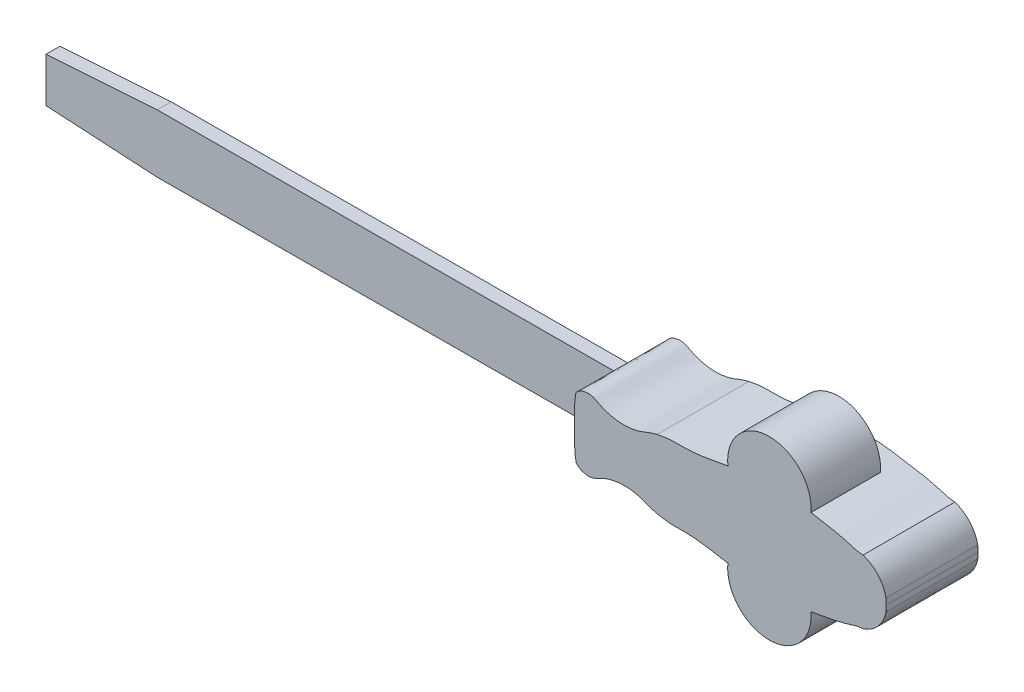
ISO-10303-21;
HEADER;
FILE_DESCRIPTION(('STEP AP214'),'2;1');
FILE_NAME('part.step','',(''),(''),'','','');
FILE_SCHEMA(('AUTOMOTIVE_DESIGN { 1 0 10303 214 1 1 1 1 }'));
ENDSEC;
DATA;
#1=APPLICATION_CONTEXT('core data for automotive mechanical design processes');
#2=APPLICATION_PROTOCOL_DEFINITION('international standard','automotive_design',2000,#1);
#3=PRODUCT_CONTEXT('',#1,'mechanical');
#4=PRODUCT('Part','Part','',(#3));
#5=PRODUCT_RELATED_PRODUCT_CATEGORY('part','',(#4));
#6=PRODUCT_DEFINITION_FORMATION('','',#4);
#7=PRODUCT_DEFINITION_CONTEXT('part definition',#1,'design');
#8=PRODUCT_DEFINITION('design','',#6,#7);
#9=PRODUCT_DEFINITION_SHAPE('','',#8);
#10=(LENGTH_UNIT() NAMED_UNIT(*) SI_UNIT(.MILLI.,.METRE.));
#11=(NAMED_UNIT(*) PLANE_ANGLE_UNIT() SI_UNIT($,.RADIAN.));
#12=(NAMED_UNIT(*) SI_UNIT($,.STERADIAN.) SOLID_ANGLE_UNIT());
#13=UNCERTAINTY_MEASURE_WITH_UNIT(LENGTH_MEASURE(1.E-05),#10,'distance_accuracy_value','');
#14=(GEOMETRIC_REPRESENTATION_CONTEXT(3) GLOBAL_UNCERTAINTY_ASSIGNED_CONTEXT((#13)) GLOBAL_UNIT_ASSIGNED_CONTEXT((#10,
#11,#12)) REPRESENTATION_CONTEXT('',''));
#15=CARTESIAN_POINT('',(0.,0.,0.));
#16=DIRECTION('',(0.,0.,1.));
#17=DIRECTION('',(1.,0.,0.));
#18=AXIS2_PLACEMENT_3D('',#15,#16,#17);
#19=CARTESIAN_POINT('',(5.05066941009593,-10.4757213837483,-2.5));
#20=DIRECTION('',(0.,0.,-1.));
#21=DIRECTION('',(-1.,0.,0.));
#22=AXIS2_PLACEMENT_3D('',#19,#20,#21);
#23=PLANE('',#22);
#24=DIRECTION('',(-0.999988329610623,-0.00483121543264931,0.));
#25=VECTOR('',#24,1.);
#26=CARTESIAN_POINT('',(5.05066941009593,-10.4757213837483,-2.5));
#27=LINE('',#26,#25);
#28=CARTESIAN_POINT('',(0.475948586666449,-10.4978231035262,-2.5));
#29=VERTEX_POINT('',#28);
#30=CARTESIAN_POINT('',(-163.946891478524,-11.2921945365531,-2.5));
#31=VERTEX_POINT('',#30);
#32=EDGE_CURVE('E233',#29,#31,#27,.T.);
#33=ORIENTED_EDGE('',*,*,#32,.T.);
#34=DIRECTION('',(-0.998342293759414,0.0575557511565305,0.));
#35=VECTOR('',#34,1.);
#36=CARTESIAN_POINT('',(4.44392236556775,-21.0001472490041,-2.5));
#37=LINE('',#36,#35);
#38=CARTESIAN_POINT('',(-203.958969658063,-8.985445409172,-2.5));
#39=VERTEX_POINT('',#38);
#40=EDGE_CURVE('E211',#31,#39,#37,.T.);
#41=ORIENTED_EDGE('',*,*,#40,.T.);
#42=DIRECTION('',(0.00483121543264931,-0.999988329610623,0.));
#43=VECTOR('',#42,1.);
#44=CARTESIAN_POINT('',(-203.946891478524,-11.485445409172,-2.5));
#45=LINE('',#44,#43);
#46=CARTESIAN_POINT('',(-204.036268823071,7.01430951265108,-2.5));
#47=VERTEX_POINT('',#46);
#48=EDGE_CURVE('E608',#47,#39,#45,.T.);
#49=ORIENTED_EDGE('',*,*,#48,.F.);
#50=DIRECTION('',(-0.997739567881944,-0.0671993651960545,0.));
#51=VECTOR('',#50,1.);
#52=CARTESIAN_POINT('',(2.93382184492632,20.9540781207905,-2.5));
#53=LINE('',#52,#51);
#54=CARTESIAN_POINT('',(-164.04834700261,9.70756038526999,-2.5));
#55=VERTEX_POINT('',#54);
#56=EDGE_CURVE('E65',#55,#47,#53,.T.);
#57=ORIENTED_EDGE('',*,*,#56,.F.);
#58=DIRECTION('',(-0.999988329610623,-0.00483121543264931,0.));
#59=VECTOR('',#58,1.);
#60=CARTESIAN_POINT('',(4.9492138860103,10.5240335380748,-2.5));
#61=LINE('',#60,#59);
#62=CARTESIAN_POINT('',(0.374493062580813,10.5019318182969,-2.5));
#63=VERTEX_POINT('',#62);
#64=EDGE_CURVE('E238',#63,#55,#61,.T.);
#65=ORIENTED_EDGE('',*,*,#64,.F.);
#66=CARTESIAN_POINT('',(-0.0328656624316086,3.40126746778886,-2.5));
#67=CARTESIAN_POINT('',(-0.224843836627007,7.16255319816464,-2.5));
#68=CARTESIAN_POINT('',(0.440236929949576,10.8822575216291,-2.5));
#69=B_SPLINE_CURVE_WITH_KNOTS('',2,(#66,#67,#68),.UNSPECIFIED.,.F.,.F.,(3,3),(0.,1.),.UNSPECIFIED.);
#70=CARTESIAN_POINT('',(-0.0328656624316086,3.40126746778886,-2.5));
#71=VERTEX_POINT('',#70);
#72=EDGE_CURVE('E271',#71,#63,#69,.T.);
#73=ORIENTED_EDGE('',*,*,#72,.F.);
#74=DIRECTION('',(-0.00966231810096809,0.999953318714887,0.));
#75=VECTOR('',#74,1.);
#76=CARTESIAN_POINT('',(0.,0.,-2.5));
#77=LINE('',#76,#75);
#78=CARTESIAN_POINT('',(0.,0.,-2.5));
#79=VERTEX_POINT('',#78);
#80=EDGE_CURVE('E585',#79,#71,#77,.T.);
#81=ORIENTED_EDGE('',*,*,#80,.F.);
#82=DIRECTION('',(0.,-1.,0.));
#83=VECTOR('',#82,1.);
#84=CARTESIAN_POINT('',(0.,0.,-2.5));
#85=LINE('',#84,#83);
#86=CARTESIAN_POINT('',(0.,-3.40142625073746,-2.5));
#87=VERTEX_POINT('',#86);
#88=EDGE_CURVE('E260',#79,#87,#85,.T.);
#89=ORIENTED_EDGE('',*,*,#88,.T.);
#90=CARTESIAN_POINT('',(0.,-3.40142625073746,-2.5));
#91=CARTESIAN_POINT('',(-0.15562647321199,-7.16439135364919,-2.5));
#92=CARTESIAN_POINT('',(0.545364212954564,-10.8774958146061,-2.5));
#93=B_SPLINE_CURVE_WITH_KNOTS('',2,(#90,#91,#92),.UNSPECIFIED.,.F.,.F.,(3,3),(0.,1.),.UNSPECIFIED.);
#94=EDGE_CURVE('E266',#87,#29,#93,.T.);
#95=ORIENTED_EDGE('',*,*,#94,.T.);
#96=EDGE_LOOP('',(#33,#41,#49,#57,#65,#73,#81,#89,#95));
#97=FACE_BOUND('',#96,.T.);
#98=ADVANCED_FACE('F41',(#97),#23,.T.);
#99=CARTESIAN_POINT('',(5.05066941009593,-10.4757213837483,2.5));
#100=DIRECTION('',(0.,0.,1.));
#101=DIRECTION('',(1.,0.,0.));
#102=AXIS2_PLACEMENT_3D('',#99,#100,#101);
#103=PLANE('',#102);
#104=DIRECTION('',(-0.00483121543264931,0.999988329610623,0.));
#105=VECTOR('',#104,1.);
#106=CARTESIAN_POINT('',(-203.946891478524,-11.485445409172,2.5));
#107=LINE('',#106,#105);
#108=CARTESIAN_POINT('',(-203.958969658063,-8.985445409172,2.5));
#109=VERTEX_POINT('',#108);
#110=CARTESIAN_POINT('',(-204.036268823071,7.01430951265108,2.5));
#111=VERTEX_POINT('',#110);
#112=EDGE_CURVE('E225',#109,#111,#107,.T.);
#113=ORIENTED_EDGE('',*,*,#112,.F.);
#114=DIRECTION('',(0.998342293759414,-0.0575557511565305,0.));
#115=VECTOR('',#114,1.);
#116=CARTESIAN_POINT('',(-203.958969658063,-8.985445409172,2.5));
#117=LINE('',#116,#115);
#118=CARTESIAN_POINT('',(-163.946891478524,-11.2921945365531,2.5));
#119=VERTEX_POINT('',#118);
#120=EDGE_CURVE('E58',#109,#119,#117,.T.);
#121=ORIENTED_EDGE('',*,*,#120,.T.);
#122=DIRECTION('',(-0.999988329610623,-0.00483121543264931,0.));
#123=VECTOR('',#122,1.);
#124=CARTESIAN_POINT('',(5.05066941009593,-10.4757213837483,2.5));
#125=LINE('',#124,#123);
#126=CARTESIAN_POINT('',(0.475948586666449,-10.4978231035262,2.5));
#127=VERTEX_POINT('',#126);
#128=EDGE_CURVE('E222',#127,#119,#125,.T.);
#129=ORIENTED_EDGE('',*,*,#128,.F.);
#130=CARTESIAN_POINT('',(0.,-3.40142625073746,2.5));
#131=CARTESIAN_POINT('',(-0.15562647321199,-7.16439135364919,2.5));
#132=CARTESIAN_POINT('',(0.545364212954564,-10.8774958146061,2.5));
#133=B_SPLINE_CURVE_WITH_KNOTS('',2,(#130,#131,#132),.UNSPECIFIED.,.F.,.F.,(3,3),(0.,1.),.UNSPECIFIED.);
#134=CARTESIAN_POINT('',(0.,-3.40142625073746,2.5));
#135=VERTEX_POINT('',#134);
#136=EDGE_CURVE('E246',#127,#135,#133,.F.);
#137=ORIENTED_EDGE('',*,*,#136,.T.);
#138=DIRECTION('',(0.,1.,0.));
#139=VECTOR('',#138,1.);
#140=CARTESIAN_POINT('',(0.,0.,2.5));
#141=LINE('',#140,#139);
#142=CARTESIAN_POINT('',(0.,0.,2.5));
#143=VERTEX_POINT('',#142);
#144=EDGE_CURVE('E243',#135,#143,#141,.T.);
#145=ORIENTED_EDGE('',*,*,#144,.T.);
#146=DIRECTION('',(0.00966231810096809,-0.999953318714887,0.));
#147=VECTOR('',#146,1.);
#148=CARTESIAN_POINT('',(0.,0.,2.5));
#149=LINE('',#148,#147);
#150=CARTESIAN_POINT('',(-0.0328656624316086,3.40126746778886,2.5));
#151=VERTEX_POINT('',#150);
#152=EDGE_CURVE('E384',#151,#143,#149,.T.);
#153=ORIENTED_EDGE('',*,*,#152,.F.);
#154=CARTESIAN_POINT('',(-0.0328656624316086,3.40126746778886,2.5));
#155=CARTESIAN_POINT('',(-0.224843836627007,7.16255319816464,2.5));
#156=CARTESIAN_POINT('',(0.440236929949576,10.8822575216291,2.5));
#157=B_SPLINE_CURVE_WITH_KNOTS('',2,(#154,#155,#156),.UNSPECIFIED.,.F.,.F.,(3,3),(0.,1.),.UNSPECIFIED.);
#158=CARTESIAN_POINT('',(0.374493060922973,10.5019318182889,2.5));
#159=VERTEX_POINT('',#158);
#160=EDGE_CURVE('E251',#159,#151,#157,.F.);
#161=ORIENTED_EDGE('',*,*,#160,.F.);
#162=DIRECTION('',(-0.999988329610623,-0.00483121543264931,0.));
#163=VECTOR('',#162,1.);
#164=CARTESIAN_POINT('',(4.9492138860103,10.5240335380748,2.5));
#165=LINE('',#164,#163);
#166=CARTESIAN_POINT('',(-164.04834700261,9.70756038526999,2.5));
#167=VERTEX_POINT('',#166);
#168=EDGE_CURVE('E232',#159,#167,#165,.T.);
#169=ORIENTED_EDGE('',*,*,#168,.T.);
#170=DIRECTION('',(0.997739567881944,0.0671993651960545,0.));
#171=VECTOR('',#170,1.);
#172=CARTESIAN_POINT('',(-204.036268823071,7.01430951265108,2.5));
#173=LINE('',#172,#171);
#174=EDGE_CURVE('E594',#111,#167,#173,.T.);
#175=ORIENTED_EDGE('',*,*,#174,.F.);
#176=EDGE_LOOP('',(#113,#121,#129,#137,#145,#153,#161,#169,#175));
#177=FACE_BOUND('',#176,.T.);
#178=ADVANCED_FACE('F221',(#177),#103,.T.);
#179=CARTESIAN_POINT('',(5.05066941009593,-10.4757213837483,2.5));
#180=DIRECTION('',(0.00483121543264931,-0.999988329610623,0.));
#181=DIRECTION('',(0.999988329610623,0.00483121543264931,0.));
#182=AXIS2_PLACEMENT_3D('',#179,#180,#181);
#183=PLANE('',#182);
#184=ORIENTED_EDGE('',*,*,#128,.T.);
#185=DIRECTION('',(0.,0.,1.));
#186=VECTOR('',#185,1.);
#187=CARTESIAN_POINT('',(-163.946891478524,-11.2921945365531,-16.5));
#188=LINE('',#187,#186);
#189=EDGE_CURVE('E208',#31,#119,#188,.T.);
#190=ORIENTED_EDGE('',*,*,#189,.F.);
#191=ORIENTED_EDGE('',*,*,#32,.F.);
#192=DIRECTION('',(0.,0.,1.));
#193=VECTOR('',#192,1.);
#194=CARTESIAN_POINT('',(0.47594858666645,-10.4978231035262,-16.5));
#195=LINE('',#194,#193);
#196=EDGE_CURVE('E230',#29,#127,#195,.T.);
#197=ORIENTED_EDGE('',*,*,#196,.T.);
#198=EDGE_LOOP('',(#184,#190,#191,#197));
#199=FACE_BOUND('',#198,.T.);
#200=ADVANCED_FACE('F228',(#199),#183,.T.);
#201=CARTESIAN_POINT('',(-203.997619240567,-0.98556794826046,0.));
#202=DIRECTION('',(-0.999988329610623,-0.00483121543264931,0.));
#203=DIRECTION('',(0.00483121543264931,-0.999988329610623,0.));
#204=AXIS2_PLACEMENT_3D('',#201,#202,#203);
#205=PLANE('',#204);
#206=ORIENTED_EDGE('',*,*,#48,.T.);
#207=DIRECTION('',(0.,0.,1.));
#208=VECTOR('',#207,1.);
#209=CARTESIAN_POINT('',(-203.958969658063,-8.985445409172,0.));
#210=LINE('',#209,#208);
#211=EDGE_CURVE('E11',#39,#109,#210,.T.);
#212=ORIENTED_EDGE('',*,*,#211,.T.);
#213=ORIENTED_EDGE('',*,*,#112,.T.);
#214=DIRECTION('',(0.,0.,1.));
#215=VECTOR('',#214,1.);
#216=CARTESIAN_POINT('',(-204.036268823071,7.01430951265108,0.));
#217=LINE('',#216,#215);
#218=EDGE_CURVE('E51',#47,#111,#217,.T.);
#219=ORIENTED_EDGE('',*,*,#218,.F.);
#220=EDGE_LOOP('',(#206,#212,#213,#219));
#221=FACE_BOUND('',#220,.T.);
#222=ADVANCED_FACE('F832',(#221),#205,.T.);
#223=CARTESIAN_POINT('',(0.,0.,-16.5));
#224=DIRECTION('',(-1.,0.,0.));
#225=DIRECTION('',(0.,0.,1.));
#226=AXIS2_PLACEMENT_3D('',#223,#224,#225);
#227=PLANE('',#226);
#228=ORIENTED_EDGE('',*,*,#88,.F.);
#229=DIRECTION('',(0.,0.,1.));
#230=VECTOR('',#229,1.);
#231=CARTESIAN_POINT('',(0.,0.,-16.5));
#232=LINE('',#231,#230);
#233=CARTESIAN_POINT('',(0.,0.,-16.5));
#234=VERTEX_POINT('',#233);
#235=EDGE_CURVE('E346',#234,#79,#232,.T.);
#236=ORIENTED_EDGE('',*,*,#235,.F.);
#237=DIRECTION('',(0.,-1.,0.));
#238=VECTOR('',#237,1.);
#239=CARTESIAN_POINT('',(0.,0.,-16.5));
#240=LINE('',#239,#238);
#241=CARTESIAN_POINT('',(0.,-3.40142625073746,-16.5));
#242=VERTEX_POINT('',#241);
#243=EDGE_CURVE('E530',#234,#242,#240,.T.);
#244=ORIENTED_EDGE('',*,*,#243,.T.);
#245=DIRECTION('',(0.,0.,1.));
#246=VECTOR('',#245,1.);
#247=CARTESIAN_POINT('',(0.,-3.40142625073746,-16.5));
#248=LINE('',#247,#246);
#249=EDGE_CURVE('E351',#242,#87,#248,.T.);
#250=ORIENTED_EDGE('',*,*,#249,.T.);
#251=EDGE_LOOP('',(#228,#236,#244,#250));
#252=FACE_BOUND('',#251,.T.);
#253=ADVANCED_FACE('F561',(#252),#227,.T.);
#254=CARTESIAN_POINT('',(0.,0.,-16.5));
#255=DIRECTION('',(0.999953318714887,0.00966231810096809,0.));
#256=DIRECTION('',(-0.00966231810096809,0.999953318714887,0.));
#257=AXIS2_PLACEMENT_3D('',#254,#255,#256);
#258=PLANE('',#257);
#259=ORIENTED_EDGE('',*,*,#235,.T.);
#260=ORIENTED_EDGE('',*,*,#80,.T.);
#261=DIRECTION('',(0.,0.,1.));
#262=VECTOR('',#261,1.);
#263=CARTESIAN_POINT('',(-0.0328656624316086,3.40126746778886,-16.5));
#264=LINE('',#263,#262);
#265=CARTESIAN_POINT('',(-0.0328656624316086,3.40126746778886,-16.5));
#266=VERTEX_POINT('',#265);
#267=EDGE_CURVE('E340',#266,#71,#264,.T.);
#268=ORIENTED_EDGE('',*,*,#267,.F.);
#269=DIRECTION('',(-0.00966231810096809,0.999953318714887,0.));
#270=VECTOR('',#269,1.);
#271=CARTESIAN_POINT('',(0.,0.,-16.5));
#272=LINE('',#271,#270);
#273=EDGE_CURVE('E524',#234,#266,#272,.T.);
#274=ORIENTED_EDGE('',*,*,#273,.F.);
#275=EDGE_LOOP('',(#259,#260,#268,#274));
#276=FACE_BOUND('',#275,.T.);
#277=ADVANCED_FACE('F564',(#276),#258,.F.);
#278=CARTESIAN_POINT('',(-0.0328656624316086,3.40126746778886,-16.5));
#279=CARTESIAN_POINT('',(-0.224843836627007,7.16255319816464,-16.5));
#280=CARTESIAN_POINT('',(0.440236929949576,10.8822575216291,-16.5));
#281=B_SPLINE_CURVE_WITH_KNOTS('',2,(#278,#279,#280),.UNSPECIFIED.,.F.,.F.,(3,3),(0.,1.),.UNSPECIFIED.);
#282=DIRECTION('',(0.,0.,1.));
#283=VECTOR('',#282,1.);
#284=SURFACE_OF_LINEAR_EXTRUSION('',#281,#283);
#285=ORIENTED_EDGE('',*,*,#267,.T.);
#286=ORIENTED_EDGE('',*,*,#72,.T.);
#287=DIRECTION('',(0.,0.,1.));
#288=VECTOR('',#287,1.);
#289=CARTESIAN_POINT('',(0.374493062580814,10.5019318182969,-16.5));
#290=LINE('',#289,#288);
#291=EDGE_CURVE('E584',#63,#159,#290,.T.);
#292=ORIENTED_EDGE('',*,*,#291,.T.);
#293=ORIENTED_EDGE('',*,*,#160,.T.);
#294=CARTESIAN_POINT('',(-0.0328656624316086,3.40126746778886,16.5));
#295=VERTEX_POINT('',#294);
#296=EDGE_CURVE('E345',#151,#295,#264,.T.);
#297=ORIENTED_EDGE('',*,*,#296,.T.);
#298=CARTESIAN_POINT('',(-0.0328656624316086,3.40126746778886,16.5));
#299=CARTESIAN_POINT('',(-0.224843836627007,7.16255319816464,16.5));
#300=CARTESIAN_POINT('',(0.440236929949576,10.8822575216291,16.5));
#301=B_SPLINE_CURVE_WITH_KNOTS('',2,(#298,#299,#300),.UNSPECIFIED.,.F.,.F.,(3,3),(0.,1.),.UNSPECIFIED.);
#302=CARTESIAN_POINT('',(0.440236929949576,10.8822575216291,16.5));
#303=VERTEX_POINT('',#302);
#304=EDGE_CURVE('E281',#295,#303,#301,.T.);
#305=ORIENTED_EDGE('',*,*,#304,.T.);
#306=DIRECTION('',(0.,0.,1.));
#307=VECTOR('',#306,1.);
#308=CARTESIAN_POINT('',(0.440236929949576,10.8822575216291,-16.5));
#309=LINE('',#308,#307);
#310=CARTESIAN_POINT('',(0.440236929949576,10.8822575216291,-16.5));
#311=VERTEX_POINT('',#310);
#312=EDGE_CURVE('E381',#311,#303,#309,.T.);
#313=ORIENTED_EDGE('',*,*,#312,.F.);
#314=EDGE_CURVE('E514',#266,#311,#281,.T.);
#315=ORIENTED_EDGE('',*,*,#314,.F.);
#316=EDGE_LOOP('',(#285,#286,#292,#293,#297,#305,#313,#315));
#317=FACE_BOUND('',#316,.T.);
#318=ADVANCED_FACE('F43',(#317),#284,.F.);
#319=CARTESIAN_POINT('',(0.440236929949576,10.8822575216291,-16.5));
#320=CARTESIAN_POINT('',(1.2545844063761,11.9870686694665,-16.5));
#321=CARTESIAN_POINT('',(3.1984745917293,12.8617459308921,-16.5));
#322=CARTESIAN_POINT('',(6.06946087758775,12.9836702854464,-16.5));
#323=CARTESIAN_POINT('',(8.10206341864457,11.9647141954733,-16.5));
#324=CARTESIAN_POINT('',(10.410042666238,10.7755542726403,-16.5));
#325=CARTESIAN_POINT('',(13.1861198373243,9.93656936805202,-16.5));
#326=CARTESIAN_POINT('',(16.5420551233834,9.38374930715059,-16.5));
#327=CARTESIAN_POINT('',(20.1718624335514,9.5213119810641,-16.5));
#328=CARTESIAN_POINT('',(24.0575079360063,10.3963118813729,-16.5));
#329=CARTESIAN_POINT('',(27.0776430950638,11.8209129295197,-16.5));
#330=CARTESIAN_POINT('',(29.0453889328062,12.3411585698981,-16.5));
#331=CARTESIAN_POINT('',(29.6585793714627,12.4932887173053,-16.5));
#332=B_SPLINE_CURVE_WITH_KNOTS('',3,(#319,#320,#321,#322,#323,#324,#325,#326,#327,#328,#329,
#330,#331),.UNSPECIFIED.,.F.,.F.,(4,1,1,1,1,1,1,1,1,1,4),(0.,0.120356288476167,
0.182103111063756,0.252493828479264,0.320379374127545,0.416926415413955,0.511670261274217,
0.625759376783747,0.741661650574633,0.867963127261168,0.924773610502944),.UNSPECIFIED.);
#333=DIRECTION('',(0.,0.,1.));
#334=VECTOR('',#333,1.);
#335=SURFACE_OF_LINEAR_EXTRUSION('',#332,#334);
#336=ORIENTED_EDGE('',*,*,#312,.T.);
#337=CARTESIAN_POINT('',(0.440236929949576,10.8822575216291,16.5));
#338=CARTESIAN_POINT('',(1.2545844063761,11.9870686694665,16.5));
#339=CARTESIAN_POINT('',(3.1984745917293,12.8617459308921,16.5));
#340=CARTESIAN_POINT('',(6.06946087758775,12.9836702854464,16.5));
#341=CARTESIAN_POINT('',(8.10206341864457,11.9647141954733,16.5));
#342=CARTESIAN_POINT('',(10.410042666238,10.7755542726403,16.5));
#343=CARTESIAN_POINT('',(13.1861198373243,9.93656936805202,16.5));
#344=CARTESIAN_POINT('',(16.5420551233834,9.38374930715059,16.5));
#345=CARTESIAN_POINT('',(20.1718624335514,9.5213119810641,16.5));
#346=CARTESIAN_POINT('',(24.0575079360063,10.3963118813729,16.5));
#347=CARTESIAN_POINT('',(27.0776430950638,11.8209129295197,16.5));
#348=CARTESIAN_POINT('',(29.0453889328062,12.3411585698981,16.5));
#349=CARTESIAN_POINT('',(29.6585793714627,12.4932887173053,16.5));
#350=B_SPLINE_CURVE_WITH_KNOTS('',3,(#337,#338,#339,#340,#341,#342,#343,#344,#345,#346,#347,
#348,#349),.UNSPECIFIED.,.F.,.F.,(4,1,1,1,1,1,1,1,1,1,4),(0.,0.120356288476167,
0.182103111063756,0.252493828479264,0.320379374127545,0.416926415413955,0.511670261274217,
0.625759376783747,0.741661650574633,0.867963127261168,0.924773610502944),.UNSPECIFIED.);
#351=CARTESIAN_POINT('',(29.6585793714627,12.4932887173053,16.5));
#352=VERTEX_POINT('',#351);
#353=EDGE_CURVE('E495',#303,#352,#350,.T.);
#354=ORIENTED_EDGE('',*,*,#353,.T.);
#355=DIRECTION('',(0.,0.,1.));
#356=VECTOR('',#355,1.);
#357=CARTESIAN_POINT('',(29.6585793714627,12.4932887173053,-16.5));
#358=LINE('',#357,#356);
#359=CARTESIAN_POINT('',(29.6585793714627,12.4932887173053,-16.5));
#360=VERTEX_POINT('',#359);
#361=EDGE_CURVE('E378',#360,#352,#358,.T.);
#362=ORIENTED_EDGE('',*,*,#361,.F.);
#363=EDGE_CURVE('E385',#311,#360,#332,.T.);
#364=ORIENTED_EDGE('',*,*,#363,.F.);
#365=EDGE_LOOP('',(#336,#354,#362,#364));
#366=FACE_BOUND('',#365,.T.);
#367=ADVANCED_FACE('F400',(#366),#335,.F.);
#368=CARTESIAN_POINT('',(29.6585793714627,12.4932887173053,-16.5));
#369=CARTESIAN_POINT('',(31.0128652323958,12.7506046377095,-16.5));
#370=CARTESIAN_POINT('',(33.0414585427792,13.2110228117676,-16.5));
#371=CARTESIAN_POINT('',(36.2612563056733,13.2560790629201,-16.5));
#372=CARTESIAN_POINT('',(39.0452583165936,13.2577644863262,-16.5));
#373=CARTESIAN_POINT('',(42.4985052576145,13.3903631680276,-16.5));
#374=CARTESIAN_POINT('',(46.0869267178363,13.7929133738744,-16.5));
#375=CARTESIAN_POINT('',(49.779062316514,14.4884361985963,-16.5));
#376=CARTESIAN_POINT('',(53.4778441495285,15.157919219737,-16.5));
#377=CARTESIAN_POINT('',(57.1168962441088,15.7270449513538,-16.5));
#378=CARTESIAN_POINT('',(60.9657898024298,16.2710657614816,-16.5));
#379=CARTESIAN_POINT('',(64.9828941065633,16.6262630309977,-16.5));
#380=CARTESIAN_POINT('',(69.1101359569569,17.0899493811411,-16.5));
#381=CARTESIAN_POINT('',(73.4451248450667,17.0625696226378,-16.5));
#382=CARTESIAN_POINT('',(77.6235824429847,16.9670082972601,-16.5));
#383=CARTESIAN_POINT('',(81.8363104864,16.3230746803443,-16.5));
#384=CARTESIAN_POINT('',(86.1669893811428,15.6372598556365,-16.5));
#385=CARTESIAN_POINT('',(91.7093018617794,14.7383170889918,-16.5));
#386=CARTESIAN_POINT('',(97.6251708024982,13.4829344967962,-16.5));
#387=CARTESIAN_POINT('',(101.818778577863,11.9447202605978,-16.5));
#388=CARTESIAN_POINT('',(103.707407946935,11.9908059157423,-16.5));
#389=B_SPLINE_CURVE_WITH_KNOTS('',3,(#368,#369,#370,#371,#372,#373,#374,#375,#376,#377,#378,
#379,#380,#381,#382,#383,#384,#385,#386,#387,#388),.UNSPECIFIED.,.F.,.F.,(4,1,1,1,1,1,1,1,1,1,1,
1,1,1,1,1,1,1,4),(0.,0.0553981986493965,0.0826774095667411,0.128818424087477,0.167035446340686,
0.221096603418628,0.273333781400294,0.317568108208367,0.371733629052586,0.420941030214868,
0.473294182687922,0.533363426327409,0.587167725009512,0.646878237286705,0.700631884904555,
0.757710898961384,0.822668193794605,0.92558882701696,1.),.UNSPECIFIED.);
#390=DIRECTION('',(0.,0.,1.));
#391=VECTOR('',#390,1.);
#392=SURFACE_OF_LINEAR_EXTRUSION('',#389,#391);
#393=CARTESIAN_POINT('',(29.6585793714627,12.4932887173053,16.5));
#394=CARTESIAN_POINT('',(31.0128652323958,12.7506046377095,16.5));
#395=CARTESIAN_POINT('',(33.0414585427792,13.2110228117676,16.5));
#396=CARTESIAN_POINT('',(36.2612563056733,13.2560790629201,16.5));
#397=CARTESIAN_POINT('',(39.0452583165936,13.2577644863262,16.5));
#398=CARTESIAN_POINT('',(42.4985052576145,13.3903631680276,16.5));
#399=CARTESIAN_POINT('',(46.0869267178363,13.7929133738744,16.5));
#400=CARTESIAN_POINT('',(49.779062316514,14.4884361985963,16.5));
#401=CARTESIAN_POINT('',(53.4778441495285,15.157919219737,16.5));
#402=CARTESIAN_POINT('',(57.1168962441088,15.7270449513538,16.5));
#403=CARTESIAN_POINT('',(60.9657898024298,16.2710657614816,16.5));
#404=CARTESIAN_POINT('',(64.9828941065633,16.6262630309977,16.5));
#405=CARTESIAN_POINT('',(69.1101359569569,17.0899493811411,16.5));
#406=CARTESIAN_POINT('',(73.4451248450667,17.0625696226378,16.5));
#407=CARTESIAN_POINT('',(77.6235824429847,16.9670082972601,16.5));
#408=CARTESIAN_POINT('',(81.8363104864,16.3230746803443,16.5));
#409=CARTESIAN_POINT('',(86.1669893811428,15.6372598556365,16.5));
#410=CARTESIAN_POINT('',(91.7093018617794,14.7383170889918,16.5));
#411=CARTESIAN_POINT('',(97.6251708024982,13.4829344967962,16.5));
#412=CARTESIAN_POINT('',(101.818778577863,11.9447202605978,16.5));
#413=CARTESIAN_POINT('',(103.707407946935,11.9908059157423,16.5));
#414=B_SPLINE_CURVE_WITH_KNOTS('',3,(#393,#394,#395,#396,#397,#398,#399,#400,#401,#402,#403,
#404,#405,#406,#407,#408,#409,#410,#411,#412,#413),.UNSPECIFIED.,.F.,.F.,(4,1,1,1,1,1,1,1,1,1,1,
1,1,1,1,1,1,1,4),(0.,0.0553981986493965,0.0826774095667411,0.128818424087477,0.167035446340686,
0.221096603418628,0.273333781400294,0.317568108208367,0.371733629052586,0.420941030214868,
0.473294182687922,0.533363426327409,0.587167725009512,0.646878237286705,0.700631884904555,
0.757710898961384,0.822668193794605,0.92558882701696,1.),.UNSPECIFIED.);
#415=CARTESIAN_POINT('',(55.0895967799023,15.4061525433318,16.5));
#416=VERTEX_POINT('',#415);
#417=EDGE_CURVE('E487',#352,#416,#414,.T.);
#418=ORIENTED_EDGE('',*,*,#417,.T.);
#419=DIRECTION('',(0.,0.,1.));
#420=VECTOR('',#419,1.);
#421=CARTESIAN_POINT('',(55.0895967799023,15.4061525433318,-8.5));
#422=LINE('',#421,#420);
#423=CARTESIAN_POINT('',(55.0895967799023,15.4061525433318,-8.5));
#424=VERTEX_POINT('',#423);
#425=EDGE_CURVE('E429',#424,#416,#422,.T.);
#426=ORIENTED_EDGE('',*,*,#425,.F.);
#427=CARTESIAN_POINT('',(55.0895967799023,15.4061525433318,-8.5));
#428=CARTESIAN_POINT('',(55.8060649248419,15.5197730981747,-8.5));
#429=CARTESIAN_POINT('',(57.7371095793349,15.8147088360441,-8.5));
#430=CARTESIAN_POINT('',(60.9657898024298,16.2710657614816,-8.5));
#431=CARTESIAN_POINT('',(64.9828941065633,16.6262630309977,-8.5));
#432=CARTESIAN_POINT('',(69.1101359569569,17.0899493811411,-8.5));
#433=CARTESIAN_POINT('',(73.4451248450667,17.0625696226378,-8.5));
#434=CARTESIAN_POINT('',(77.6235824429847,16.9670082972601,-8.5));
#435=CARTESIAN_POINT('',(81.4946798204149,16.3752943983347,-8.5));
#436=CARTESIAN_POINT('',(83.8851899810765,15.9983753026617,-8.5));
#437=CARTESIAN_POINT('',(84.9507542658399,15.8287112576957,-8.5));
#438=B_SPLINE_CURVE_WITH_KNOTS('',3,(#427,#428,#429,#430,#431,#432,#433,#434,#435,#436,#437),
.UNSPECIFIED.,.F.,.F.,(4,1,1,1,1,1,1,1,4),(0.342661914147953,0.371733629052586,
0.420941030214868,0.473294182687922,0.533363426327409,0.587167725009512,0.646878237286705,
0.700631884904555,0.743880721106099),.UNSPECIFIED.);
#439=CARTESIAN_POINT('',(84.9507542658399,15.8287112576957,-8.5));
#440=VERTEX_POINT('',#439);
#441=EDGE_CURVE('E436',#424,#440,#438,.T.);
#442=ORIENTED_EDGE('',*,*,#441,.T.);
#443=DIRECTION('',(0.,0.,1.));
#444=VECTOR('',#443,1.);
#445=CARTESIAN_POINT('',(84.9507542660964,15.828711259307,-8.5));
#446=LINE('',#445,#444);
#447=CARTESIAN_POINT('',(84.9507542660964,15.828711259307,16.5));
#448=VERTEX_POINT('',#447);
#449=EDGE_CURVE('E420',#440,#448,#446,.T.);
#450=ORIENTED_EDGE('',*,*,#449,.T.);
#451=CARTESIAN_POINT('',(103.707407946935,11.9908059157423,16.5));
#452=VERTEX_POINT('',#451);
#453=EDGE_CURVE('E496',#448,#452,#414,.T.);
#454=ORIENTED_EDGE('',*,*,#453,.T.);
#455=DIRECTION('',(0.,0.,1.));
#456=VECTOR('',#455,1.);
#457=CARTESIAN_POINT('',(103.707407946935,11.9908059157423,-16.5));
#458=LINE('',#457,#456);
#459=CARTESIAN_POINT('',(103.707407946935,11.9908059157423,-16.5));
#460=VERTEX_POINT('',#459);
#461=EDGE_CURVE('E374',#460,#452,#458,.T.);
#462=ORIENTED_EDGE('',*,*,#461,.F.);
#463=EDGE_CURVE('E391',#360,#460,#389,.T.);
#464=ORIENTED_EDGE('',*,*,#463,.F.);
#465=ORIENTED_EDGE('',*,*,#361,.T.);
#466=EDGE_LOOP('',(#418,#426,#442,#450,#454,#462,#464,#465));
#467=FACE_BOUND('',#466,.T.);
#468=ADVANCED_FACE('F404',(#467),#392,.F.);
#469=CARTESIAN_POINT('',(103.707407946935,11.9908059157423,-16.5));
#470=CARTESIAN_POINT('',(105.28126794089,11.4133673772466,-16.5));
#471=CARTESIAN_POINT('',(109.12557010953,9.28181191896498,-16.5));
#472=CARTESIAN_POINT('',(111.416904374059,5.30759409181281,-16.5));
#473=CARTESIAN_POINT('',(111.90109030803,2.73355710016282,-16.5));
#474=B_SPLINE_CURVE_WITH_KNOTS('',3,(#469,#470,#471,#472,#473),.UNSPECIFIED.,.F.,.F.,(4,1,4),
(0.,0.39082533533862,1.),.UNSPECIFIED.);
#475=DIRECTION('',(0.,0.,1.));
#476=VECTOR('',#475,1.);
#477=SURFACE_OF_LINEAR_EXTRUSION('',#474,#476);
#478=ORIENTED_EDGE('',*,*,#461,.T.);
#479=CARTESIAN_POINT('',(103.707407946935,11.9908059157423,16.5));
#480=CARTESIAN_POINT('',(105.28126794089,11.4133673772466,16.5));
#481=CARTESIAN_POINT('',(109.12557010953,9.28181191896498,16.5));
#482=CARTESIAN_POINT('',(111.416904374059,5.30759409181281,16.5));
#483=CARTESIAN_POINT('',(111.90109030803,2.73355710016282,16.5));
#484=B_SPLINE_CURVE_WITH_KNOTS('',3,(#479,#480,#481,#482,#483),.UNSPECIFIED.,.F.,.F.,(4,1,4),
(0.,0.39082533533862,1.),.UNSPECIFIED.);
#485=CARTESIAN_POINT('',(111.90109030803,2.73355710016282,16.5));
#486=VERTEX_POINT('',#485);
#487=EDGE_CURVE('E502',#452,#486,#484,.T.);
#488=ORIENTED_EDGE('',*,*,#487,.T.);
#489=DIRECTION('',(0.,0.,1.));
#490=VECTOR('',#489,1.);
#491=CARTESIAN_POINT('',(111.90109030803,2.73355710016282,-16.5));
#492=LINE('',#491,#490);
#493=CARTESIAN_POINT('',(111.90109030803,2.73355710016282,-16.5));
#494=VERTEX_POINT('',#493);
#495=EDGE_CURVE('E371',#494,#486,#492,.T.);
#496=ORIENTED_EDGE('',*,*,#495,.F.);
#497=EDGE_CURVE('E706',#460,#494,#474,.T.);
#498=ORIENTED_EDGE('',*,*,#497,.F.);
#499=EDGE_LOOP('',(#478,#488,#496,#498));
#500=FACE_BOUND('',#499,.T.);
#501=ADVANCED_FACE('F411',(#500),#477,.F.);
#502=CARTESIAN_POINT('',(112.,0.541102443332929,-16.5));
#503=CARTESIAN_POINT('',(111.994702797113,1.63754310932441,-16.5));
#504=CARTESIAN_POINT('',(111.90109030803,2.73355710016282,-16.5));
#505=B_SPLINE_CURVE_WITH_KNOTS('',2,(#502,#503,#504),.UNSPECIFIED.,.F.,.F.,(3,3),(0.5,1.),.UNSPECIFIED.);
#506=DIRECTION('',(0.,0.,1.));
#507=VECTOR('',#506,1.);
#508=SURFACE_OF_LINEAR_EXTRUSION('',#505,#507);
#509=ORIENTED_EDGE('',*,*,#495,.T.);
#510=CARTESIAN_POINT('',(112.,0.541102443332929,16.5));
#511=CARTESIAN_POINT('',(111.994702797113,1.63754310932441,16.5));
#512=CARTESIAN_POINT('',(111.90109030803,2.73355710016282,16.5));
#513=B_SPLINE_CURVE_WITH_KNOTS('',2,(#510,#511,#512),.UNSPECIFIED.,.F.,.F.,(3,3),(0.5,1.),.UNSPECIFIED.);
#514=CARTESIAN_POINT('',(112.,0.54110244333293,16.5));
#515=VERTEX_POINT('',#514);
#516=EDGE_CURVE('E737',#515,#486,#513,.T.);
#517=ORIENTED_EDGE('',*,*,#516,.F.);
#518=DIRECTION('',(0.,0.,1.));
#519=VECTOR('',#518,1.);
#520=CARTESIAN_POINT('',(112.,0.54110244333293,-16.5));
#521=LINE('',#520,#519);
#522=CARTESIAN_POINT('',(112.,0.54110244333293,-16.5));
#523=VERTEX_POINT('',#522);
#524=EDGE_CURVE('E368',#523,#515,#521,.T.);
#525=ORIENTED_EDGE('',*,*,#524,.F.);
#526=EDGE_CURVE('E708',#523,#494,#505,.T.);
#527=ORIENTED_EDGE('',*,*,#526,.T.);
#528=EDGE_LOOP('',(#509,#517,#525,#527));
#529=FACE_BOUND('',#528,.T.);
#530=ADVANCED_FACE('F726',(#529),#508,.T.);
#531=CARTESIAN_POINT('',(112.,0.541102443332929,-16.5));
#532=CARTESIAN_POINT('',(112.005297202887,-0.555338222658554,-16.5));
#533=CARTESIAN_POINT('',(111.922279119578,-1.65220556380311,-16.5));
#534=B_SPLINE_CURVE_WITH_KNOTS('',2,(#531,#532,#533),.UNSPECIFIED.,.F.,.F.,(3,3),(0.5,1.),.UNSPECIFIED.);
#535=DIRECTION('',(0.,0.,1.));
#536=VECTOR('',#535,1.);
#537=SURFACE_OF_LINEAR_EXTRUSION('',#534,#536);
#538=ORIENTED_EDGE('',*,*,#524,.T.);
#539=CARTESIAN_POINT('',(112.,0.541102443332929,16.5));
#540=CARTESIAN_POINT('',(112.005297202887,-0.555338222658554,16.5));
#541=CARTESIAN_POINT('',(111.922279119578,-1.65220556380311,16.5));
#542=B_SPLINE_CURVE_WITH_KNOTS('',2,(#539,#540,#541),.UNSPECIFIED.,.F.,.F.,(3,3),(0.5,1.),.UNSPECIFIED.);
#543=CARTESIAN_POINT('',(111.922279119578,-1.65220556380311,16.5));
#544=VERTEX_POINT('',#543);
#545=EDGE_CURVE('E743',#515,#544,#542,.T.);
#546=ORIENTED_EDGE('',*,*,#545,.T.);
#547=DIRECTION('',(0.,0.,1.));
#548=VECTOR('',#547,1.);
#549=CARTESIAN_POINT('',(111.922279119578,-1.65220556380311,-16.5));
#550=LINE('',#549,#548);
#551=CARTESIAN_POINT('',(111.922279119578,-1.65220556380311,-16.5));
#552=VERTEX_POINT('',#551);
#553=EDGE_CURVE('E365',#552,#544,#550,.T.);
#554=ORIENTED_EDGE('',*,*,#553,.F.);
#555=EDGE_CURVE('E638',#523,#552,#534,.T.);
#556=ORIENTED_EDGE('',*,*,#555,.F.);
#557=EDGE_LOOP('',(#538,#546,#554,#556));
#558=FACE_BOUND('',#557,.T.);
#559=ADVANCED_FACE('F724',(#558),#537,.F.);
#560=CARTESIAN_POINT('',(103.818425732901,-10.9881922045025,-16.5));
#561=CARTESIAN_POINT('',(105.386632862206,-10.3955734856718,-16.5));
#562=CARTESIAN_POINT('',(109.210159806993,-8.22697266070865,-16.5));
#563=CARTESIAN_POINT('',(111.462986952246,-4.23080075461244,-16.5));
#564=CARTESIAN_POINT('',(111.922279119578,-1.65220556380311,-16.5));
#565=B_SPLINE_CURVE_WITH_KNOTS('',3,(#560,#561,#562,#563,#564),.UNSPECIFIED.,.F.,.F.,(4,1,4),
(0.,0.39082533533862,1.),.UNSPECIFIED.);
#566=DIRECTION('',(0.,0.,1.));
#567=VECTOR('',#566,1.);
#568=SURFACE_OF_LINEAR_EXTRUSION('',#565,#567);
#569=ORIENTED_EDGE('',*,*,#553,.T.);
#570=CARTESIAN_POINT('',(103.818425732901,-10.9881922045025,16.5));
#571=CARTESIAN_POINT('',(105.386632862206,-10.3955734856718,16.5));
#572=CARTESIAN_POINT('',(109.210159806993,-8.22697266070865,16.5));
#573=CARTESIAN_POINT('',(111.462986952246,-4.23080075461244,16.5));
#574=CARTESIAN_POINT('',(111.922279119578,-1.65220556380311,16.5));
#575=B_SPLINE_CURVE_WITH_KNOTS('',3,(#570,#571,#572,#573,#574),.UNSPECIFIED.,.F.,.F.,(4,1,4),
(0.,0.39082533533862,1.),.UNSPECIFIED.);
#576=CARTESIAN_POINT('',(103.818425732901,-10.9881922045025,16.5));
#577=VERTEX_POINT('',#576);
#578=EDGE_CURVE('E325',#577,#544,#575,.T.);
#579=ORIENTED_EDGE('',*,*,#578,.F.);
#580=DIRECTION('',(0.,0.,1.));
#581=VECTOR('',#580,1.);
#582=CARTESIAN_POINT('',(103.818425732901,-10.9881922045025,-16.5));
#583=LINE('',#582,#581);
#584=CARTESIAN_POINT('',(103.818425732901,-10.9881922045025,-16.5));
#585=VERTEX_POINT('',#584);
#586=EDGE_CURVE('E361',#585,#577,#583,.T.);
#587=ORIENTED_EDGE('',*,*,#586,.F.);
#588=EDGE_CURVE('E634',#585,#552,#565,.T.);
#589=ORIENTED_EDGE('',*,*,#588,.T.);
#590=EDGE_LOOP('',(#569,#579,#587,#589));
#591=FACE_BOUND('',#590,.T.);
#592=ADVANCED_FACE('F654',(#591),#568,.T.);
#593=CARTESIAN_POINT('',(29.7779090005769,-12.2061348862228,-16.5));
#594=CARTESIAN_POINT('',(31.134617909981,-12.4503532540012,-16.5));
#595=CARTESIAN_POINT('',(33.1675652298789,-12.8911490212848,-16.5));
#596=CARTESIAN_POINT('',(36.3876480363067,-12.9050924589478,-16.5));
#597=CARTESIAN_POINT('',(39.1715363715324,-12.8798778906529,-16.5));
#598=CARTESIAN_POINT('',(42.6259033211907,-12.9791040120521,-16.5));
#599=CARTESIAN_POINT('',(46.2180468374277,-13.3469629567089,-16.5));
#600=CARTESIAN_POINT('',(49.9167304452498,-14.0067787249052,-16.5));
#601=CARTESIAN_POINT('',(53.6218083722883,-14.6404916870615,-16.5));
#602=CARTESIAN_POINT('',(57.2661896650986,-15.1744291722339,-16.5));
#603=CARTESIAN_POINT('',(61.1201600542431,-15.6812353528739,-16.5));
#604=CARTESIAN_POINT('',(65.1405088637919,-15.9976015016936,-16.5));
#605=CARTESIAN_POINT('',(69.2720383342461,-16.4213874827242,-16.5));
#606=CARTESIAN_POINT('',(73.6065603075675,-16.3521229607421,-16.5));
#607=CARTESIAN_POINT('',(77.7838995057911,-16.2161925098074,-16.5));
#608=CARTESIAN_POINT('',(81.9902090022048,-15.5315842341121,-16.5));
#609=CARTESIAN_POINT('',(86.3140591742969,-14.8039570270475,-16.5));
#610=CARTESIAN_POINT('',(91.8474270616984,-13.8515046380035,-16.5));
#611=CARTESIAN_POINT('',(97.7508899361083,-12.5390196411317,-16.5));
#612=CARTESIAN_POINT('',(101.929439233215,-10.9603572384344,-16.5));
#613=CARTESIAN_POINT('',(103.818425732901,-10.9881922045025,-16.5));
#614=B_SPLINE_CURVE_WITH_KNOTS('',3,(#593,#594,#595,#596,#597,#598,#599,#600,#601,#602,#603,
#604,#605,#606,#607,#608,#609,#610,#611,#612,#613),.UNSPECIFIED.,.F.,.F.,(4,1,1,1,1,1,1,1,1,1,1,
1,1,1,1,1,1,1,4),(0.,0.0553981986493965,0.0826774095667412,0.128818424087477,0.167035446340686,
0.221096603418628,0.273333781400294,0.317568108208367,0.371733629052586,0.420941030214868,
0.473294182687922,0.533363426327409,0.587167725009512,0.646878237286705,0.700631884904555,
0.757710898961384,0.822668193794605,0.92558882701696,1.),.UNSPECIFIED.);
#615=DIRECTION('',(0.,0.,1.));
#616=VECTOR('',#615,1.);
#617=SURFACE_OF_LINEAR_EXTRUSION('',#614,#616);
#618=DIRECTION('',(0.,0.,1.));
#619=VECTOR('',#618,1.);
#620=CARTESIAN_POINT('',(55.0764935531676,-14.8493703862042,-8.5));
#621=LINE('',#620,#619);
#622=CARTESIAN_POINT('',(55.0764935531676,-14.8493703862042,-8.5));
#623=VERTEX_POINT('',#622);
#624=CARTESIAN_POINT('',(55.0764935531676,-14.8493703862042,16.5));
#625=VERTEX_POINT('',#624);
#626=EDGE_CURVE('E674',#623,#625,#621,.T.);
#627=ORIENTED_EDGE('',*,*,#626,.T.);
#628=CARTESIAN_POINT('',(29.7779090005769,-12.2061348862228,16.5));
#629=CARTESIAN_POINT('',(31.134617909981,-12.4503532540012,16.5));
#630=CARTESIAN_POINT('',(33.1675652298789,-12.8911490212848,16.5));
#631=CARTESIAN_POINT('',(36.3876480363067,-12.9050924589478,16.5));
#632=CARTESIAN_POINT('',(39.1715363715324,-12.8798778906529,16.5));
#633=CARTESIAN_POINT('',(42.6259033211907,-12.9791040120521,16.5));
#634=CARTESIAN_POINT('',(46.2180468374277,-13.3469629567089,16.5));
#635=CARTESIAN_POINT('',(49.9167304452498,-14.0067787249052,16.5));
#636=CARTESIAN_POINT('',(53.6218083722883,-14.6404916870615,16.5));
#637=CARTESIAN_POINT('',(57.2661896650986,-15.1744291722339,16.5));
#638=CARTESIAN_POINT('',(61.1201600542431,-15.6812353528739,16.5));
#639=CARTESIAN_POINT('',(65.1405088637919,-15.9976015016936,16.5));
#640=CARTESIAN_POINT('',(69.2720383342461,-16.4213874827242,16.5));
#641=CARTESIAN_POINT('',(73.6065603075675,-16.3521229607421,16.5));
#642=CARTESIAN_POINT('',(77.7838995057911,-16.2161925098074,16.5));
#643=CARTESIAN_POINT('',(81.9902090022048,-15.5315842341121,16.5));
#644=CARTESIAN_POINT('',(86.3140591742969,-14.8039570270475,16.5));
#645=CARTESIAN_POINT('',(91.8474270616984,-13.8515046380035,16.5));
#646=CARTESIAN_POINT('',(97.7508899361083,-12.5390196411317,16.5));
#647=CARTESIAN_POINT('',(101.929439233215,-10.9603572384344,16.5));
#648=CARTESIAN_POINT('',(103.818425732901,-10.9881922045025,16.5));
#649=B_SPLINE_CURVE_WITH_KNOTS('',3,(#628,#629,#630,#631,#632,#633,#634,#635,#636,#637,#638,
#639,#640,#641,#642,#643,#644,#645,#646,#647,#648),.UNSPECIFIED.,.F.,.F.,(4,1,1,1,1,1,1,1,1,1,1,
1,1,1,1,1,1,1,4),(0.,0.0553981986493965,0.0826774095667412,0.128818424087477,0.167035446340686,
0.221096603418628,0.273333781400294,0.317568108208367,0.371733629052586,0.420941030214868,
0.473294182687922,0.533363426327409,0.587167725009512,0.646878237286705,0.700631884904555,
0.757710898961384,0.822668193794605,0.92558882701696,1.),.UNSPECIFIED.);
#650=CARTESIAN_POINT('',(29.7779090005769,-12.2061348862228,16.5));
#651=VERTEX_POINT('',#650);
#652=EDGE_CURVE('E336',#651,#625,#649,.T.);
#653=ORIENTED_EDGE('',*,*,#652,.F.);
#654=DIRECTION('',(0.,0.,1.));
#655=VECTOR('',#654,1.);
#656=CARTESIAN_POINT('',(29.7779090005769,-12.2061348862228,-16.5));
#657=LINE('',#656,#655);
#658=CARTESIAN_POINT('',(29.7779090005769,-12.2061348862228,-16.5));
#659=VERTEX_POINT('',#658);
#660=EDGE_CURVE('E358',#659,#651,#657,.T.);
#661=ORIENTED_EDGE('',*,*,#660,.F.);
#662=EDGE_CURVE('E630',#659,#585,#614,.T.);
#663=ORIENTED_EDGE('',*,*,#662,.T.);
#664=ORIENTED_EDGE('',*,*,#586,.T.);
#665=CARTESIAN_POINT('',(84.9410694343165,-15.0339759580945,16.5));
#666=VERTEX_POINT('',#665);
#667=EDGE_CURVE('E317',#666,#577,#649,.T.);
#668=ORIENTED_EDGE('',*,*,#667,.F.);
#669=DIRECTION('',(0.,0.,1.));
#670=VECTOR('',#669,1.);
#671=CARTESIAN_POINT('',(84.9410694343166,-15.0339759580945,-8.5));
#672=LINE('',#671,#670);
#673=CARTESIAN_POINT('',(84.9410694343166,-15.0339759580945,-8.5));
#674=VERTEX_POINT('',#673);
#675=EDGE_CURVE('E291',#674,#666,#672,.T.);
#676=ORIENTED_EDGE('',*,*,#675,.F.);
#677=CARTESIAN_POINT('',(84.9410694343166,-15.0339759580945,-8.5));
#678=CARTESIAN_POINT('',(83.9300533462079,-15.2048289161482,-8.5));
#679=CARTESIAN_POINT('',(81.5960721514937,-15.5957329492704,-8.5));
#680=CARTESIAN_POINT('',(77.7838995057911,-16.2161925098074,-8.5));
#681=CARTESIAN_POINT('',(73.6065603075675,-16.3521229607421,-8.5));
#682=CARTESIAN_POINT('',(69.2720383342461,-16.4213874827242,-8.5));
#683=CARTESIAN_POINT('',(65.1405088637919,-15.9976015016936,-8.5));
#684=CARTESIAN_POINT('',(61.1201600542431,-15.6812353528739,-8.5));
#685=CARTESIAN_POINT('',(57.8339431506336,-15.2490900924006,-8.5));
#686=CARTESIAN_POINT('',(55.8470548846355,-14.9646211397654,-8.5));
#687=CARTESIAN_POINT('',(55.0764935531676,-14.8493703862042,-8.5));
#688=B_SPLINE_CURVE_WITH_KNOTS('',3,(#677,#678,#679,#680,#681,#682,#683,#684,#685,#686,#687),
.UNSPECIFIED.,.F.,.F.,(4,1,1,1,1,1,1,1,4),(0.340509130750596,0.38160802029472,0.43536166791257,
0.495072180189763,0.548876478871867,0.608945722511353,0.661298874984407,0.710506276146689,
0.741730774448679),.UNSPECIFIED.);
#689=EDGE_CURVE('E668',#674,#623,#688,.T.);
#690=ORIENTED_EDGE('',*,*,#689,.T.);
#691=EDGE_LOOP('',(#627,#653,#661,#663,#664,#668,#676,#690));
#692=FACE_BOUND('',#691,.T.);
#693=ADVANCED_FACE('F650',(#692),#617,.T.);
#694=CARTESIAN_POINT('',(0.545364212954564,-10.8774958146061,-16.5));
#695=CARTESIAN_POINT('',(1.37034871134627,-11.9743869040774,-16.5));
#696=CARTESIAN_POINT('',(3.32259956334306,-12.8302408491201,-16.5));
#697=CARTESIAN_POINT('',(6.19462989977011,-12.9244191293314,-16.5));
#698=CARTESIAN_POINT('',(8.21729207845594,-11.8858709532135,-16.5));
#699=CARTESIAN_POINT('',(10.5136735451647,-10.6744661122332,-16.5));
#700=CARTESIAN_POINT('',(13.281514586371,-9.80869703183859,-16.5));
#701=CARTESIAN_POINT('',(16.6319516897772,-9.22347666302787,-16.5));
#702=CARTESIAN_POINT('',(20.2629187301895,-9.32596056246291,-16.5));
#703=CARTESIAN_POINT('',(24.1568373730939,-10.1633752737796,-16.5));
#704=CARTESIAN_POINT('',(27.1905964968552,-11.558728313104,-16.5));
#705=CARTESIAN_POINT('',(29.1632772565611,-12.0599366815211,-16.5));
#706=CARTESIAN_POINT('',(29.7779090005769,-12.2061348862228,-16.5));
#707=B_SPLINE_CURVE_WITH_KNOTS('',3,(#694,#695,#696,#697,#698,#699,#700,#701,#702,#703,#704,
#705,#706),.UNSPECIFIED.,.F.,.F.,(4,1,1,1,1,1,1,1,1,1,4),(0.,0.120356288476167,
0.182103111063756,0.252493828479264,0.320379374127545,0.416926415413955,0.511670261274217,
0.625759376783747,0.741661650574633,0.867963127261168,0.924773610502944),.UNSPECIFIED.);
#708=DIRECTION('',(0.,0.,1.));
#709=VECTOR('',#708,1.);
#710=SURFACE_OF_LINEAR_EXTRUSION('',#707,#709);
#711=ORIENTED_EDGE('',*,*,#660,.T.);
#712=CARTESIAN_POINT('',(0.545364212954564,-10.8774958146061,16.5));
#713=CARTESIAN_POINT('',(1.37034871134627,-11.9743869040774,16.5));
#714=CARTESIAN_POINT('',(3.32259956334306,-12.8302408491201,16.5));
#715=CARTESIAN_POINT('',(6.19462989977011,-12.9244191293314,16.5));
#716=CARTESIAN_POINT('',(8.21729207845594,-11.8858709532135,16.5));
#717=CARTESIAN_POINT('',(10.5136735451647,-10.6744661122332,16.5));
#718=CARTESIAN_POINT('',(13.281514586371,-9.80869703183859,16.5));
#719=CARTESIAN_POINT('',(16.6319516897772,-9.22347666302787,16.5));
#720=CARTESIAN_POINT('',(20.2629187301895,-9.32596056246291,16.5));
#721=CARTESIAN_POINT('',(24.1568373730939,-10.1633752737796,16.5));
#722=CARTESIAN_POINT('',(27.1905964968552,-11.558728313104,16.5));
#723=CARTESIAN_POINT('',(29.1632772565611,-12.0599366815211,16.5));
#724=CARTESIAN_POINT('',(29.7779090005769,-12.2061348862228,16.5));
#725=B_SPLINE_CURVE_WITH_KNOTS('',3,(#712,#713,#714,#715,#716,#717,#718,#719,#720,#721,#722,
#723,#724),.UNSPECIFIED.,.F.,.F.,(4,1,1,1,1,1,1,1,1,1,4),(0.,0.120356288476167,
0.182103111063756,0.252493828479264,0.320379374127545,0.416926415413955,0.511670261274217,
0.625759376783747,0.741661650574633,0.867963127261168,0.924773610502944),.UNSPECIFIED.);
#726=CARTESIAN_POINT('',(0.545364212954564,-10.8774958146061,16.5));
#727=VERTEX_POINT('',#726);
#728=EDGE_CURVE('E308',#727,#651,#725,.T.);
#729=ORIENTED_EDGE('',*,*,#728,.F.);
#730=DIRECTION('',(0.,0.,1.));
#731=VECTOR('',#730,1.);
#732=CARTESIAN_POINT('',(0.545364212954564,-10.8774958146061,-16.5));
#733=LINE('',#732,#731);
#734=CARTESIAN_POINT('',(0.545364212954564,-10.8774958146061,-16.5));
#735=VERTEX_POINT('',#734);
#736=EDGE_CURVE('E355',#735,#727,#733,.T.);
#737=ORIENTED_EDGE('',*,*,#736,.F.);
#738=EDGE_CURVE('E541',#735,#659,#707,.T.);
#739=ORIENTED_EDGE('',*,*,#738,.T.);
#740=EDGE_LOOP('',(#711,#729,#737,#739));
#741=FACE_BOUND('',#740,.T.);
#742=ADVANCED_FACE('F555',(#741),#710,.T.);
#743=CARTESIAN_POINT('',(0.,-3.40142625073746,-16.5));
#744=CARTESIAN_POINT('',(-0.15562647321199,-7.16439135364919,-16.5));
#745=CARTESIAN_POINT('',(0.545364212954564,-10.8774958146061,-16.5));
#746=B_SPLINE_CURVE_WITH_KNOTS('',2,(#743,#744,#745),.UNSPECIFIED.,.F.,.F.,(3,3),(0.,1.),.UNSPECIFIED.);
#747=DIRECTION('',(0.,0.,1.));
#748=VECTOR('',#747,1.);
#749=SURFACE_OF_LINEAR_EXTRUSION('',#746,#748);
#750=ORIENTED_EDGE('',*,*,#94,.F.);
#751=ORIENTED_EDGE('',*,*,#249,.F.);
#752=EDGE_CURVE('E534',#242,#735,#746,.T.);
#753=ORIENTED_EDGE('',*,*,#752,.T.);
#754=ORIENTED_EDGE('',*,*,#736,.T.);
#755=CARTESIAN_POINT('',(0.,-3.40142625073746,16.5));
#756=CARTESIAN_POINT('',(-0.15562647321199,-7.16439135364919,16.5));
#757=CARTESIAN_POINT('',(0.545364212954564,-10.8774958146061,16.5));
#758=B_SPLINE_CURVE_WITH_KNOTS('',2,(#755,#756,#757),.UNSPECIFIED.,.F.,.F.,(3,3),(0.,1.),.UNSPECIFIED.);
#759=CARTESIAN_POINT('',(0.,-3.40142625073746,16.5));
#760=VERTEX_POINT('',#759);
#761=EDGE_CURVE('E302',#760,#727,#758,.T.);
#762=ORIENTED_EDGE('',*,*,#761,.F.);
#763=EDGE_CURVE('E350',#135,#760,#248,.T.);
#764=ORIENTED_EDGE('',*,*,#763,.F.);
#765=ORIENTED_EDGE('',*,*,#136,.F.);
#766=ORIENTED_EDGE('',*,*,#196,.F.);
#767=EDGE_LOOP('',(#750,#751,#753,#754,#762,#764,#765,#766));
#768=FACE_BOUND('',#767,.T.);
#769=ADVANCED_FACE('F550',(#768),#749,.T.);
#770=ORIENTED_EDGE('',*,*,#144,.F.);
#771=ORIENTED_EDGE('',*,*,#763,.T.);
#772=DIRECTION('',(0.,-1.,0.));
#773=VECTOR('',#772,1.);
#774=CARTESIAN_POINT('',(0.,0.,16.5));
#775=LINE('',#774,#773);
#776=CARTESIAN_POINT('',(0.,0.,16.5));
#777=VERTEX_POINT('',#776);
#778=EDGE_CURVE('E298',#777,#760,#775,.T.);
#779=ORIENTED_EDGE('',*,*,#778,.F.);
#780=EDGE_CURVE('E344',#143,#777,#232,.T.);
#781=ORIENTED_EDGE('',*,*,#780,.F.);
#782=EDGE_LOOP('',(#770,#771,#779,#781));
#783=FACE_BOUND('',#782,.T.);
#784=ADVANCED_FACE('F554',(#783),#227,.T.);
#785=ORIENTED_EDGE('',*,*,#296,.F.);
#786=ORIENTED_EDGE('',*,*,#152,.T.);
#787=ORIENTED_EDGE('',*,*,#780,.T.);
#788=DIRECTION('',(-0.00966231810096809,0.999953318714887,0.));
#789=VECTOR('',#788,1.);
#790=CARTESIAN_POINT('',(0.,0.,16.5));
#791=LINE('',#790,#789);
#792=EDGE_CURVE('E290',#777,#295,#791,.T.);
#793=ORIENTED_EDGE('',*,*,#792,.T.);
#794=EDGE_LOOP('',(#785,#786,#787,#793));
#795=FACE_BOUND('',#794,.T.);
#796=ADVANCED_FACE('F559',(#795),#258,.F.);
#797=CARTESIAN_POINT('',(0.,0.,-16.5));
#798=DIRECTION('',(0.,0.,1.));
#799=DIRECTION('',(1.,0.,0.));
#800=AXIS2_PLACEMENT_3D('',#797,#798,#799);
#801=PLANE('',#800);
#802=ORIENTED_EDGE('',*,*,#314,.T.);
#803=ORIENTED_EDGE('',*,*,#363,.T.);
#804=ORIENTED_EDGE('',*,*,#463,.T.);
#805=ORIENTED_EDGE('',*,*,#497,.T.);
#806=ORIENTED_EDGE('',*,*,#526,.F.);
#807=ORIENTED_EDGE('',*,*,#555,.T.);
#808=ORIENTED_EDGE('',*,*,#588,.F.);
#809=ORIENTED_EDGE('',*,*,#662,.F.);
#810=ORIENTED_EDGE('',*,*,#738,.F.);
#811=ORIENTED_EDGE('',*,*,#752,.F.);
#812=ORIENTED_EDGE('',*,*,#243,.F.);
#813=ORIENTED_EDGE('',*,*,#273,.T.);
#814=EDGE_LOOP('',(#802,#803,#804,#805,#806,#807,#808,#809,#810,#811,#812,#813));
#815=FACE_BOUND('',#814,.T.);
#816=ADVANCED_FACE('F406',(#815),#801,.F.);
#817=CARTESIAN_POINT('',(0.,0.,16.5));
#818=DIRECTION('',(0.,0.,1.));
#819=DIRECTION('',(1.,0.,0.));
#820=AXIS2_PLACEMENT_3D('',#817,#818,#819);
#821=PLANE('',#820);
#822=ORIENTED_EDGE('',*,*,#304,.F.);
#823=ORIENTED_EDGE('',*,*,#792,.F.);
#824=ORIENTED_EDGE('',*,*,#778,.T.);
#825=ORIENTED_EDGE('',*,*,#761,.T.);
#826=ORIENTED_EDGE('',*,*,#728,.T.);
#827=ORIENTED_EDGE('',*,*,#652,.T.);
#828=CARTESIAN_POINT('',(70.,-16.3622997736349,16.5));
#829=DIRECTION('',(0.,0.,1.));
#830=DIRECTION('',(1.,0.,0.));
#831=AXIS2_PLACEMENT_3D('',#828,#829,#830);
#832=CIRCLE('',#831,15.);
#833=EDGE_CURVE('E442',#625,#666,#832,.T.);
#834=ORIENTED_EDGE('',*,*,#833,.T.);
#835=ORIENTED_EDGE('',*,*,#667,.T.);
#836=ORIENTED_EDGE('',*,*,#578,.T.);
#837=ORIENTED_EDGE('',*,*,#545,.F.);
#838=ORIENTED_EDGE('',*,*,#516,.T.);
#839=ORIENTED_EDGE('',*,*,#487,.F.);
#840=ORIENTED_EDGE('',*,*,#453,.F.);
#841=CARTESIAN_POINT('',(70.,17.0431851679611,16.5));
#842=DIRECTION('',(0.,0.,1.));
#843=DIRECTION('',(1.,0.,0.));
#844=AXIS2_PLACEMENT_3D('',#841,#842,#843);
#845=CIRCLE('',#844,15.);
#846=EDGE_CURVE('E280',#448,#416,#845,.T.);
#847=ORIENTED_EDGE('',*,*,#846,.T.);
#848=ORIENTED_EDGE('',*,*,#417,.F.);
#849=ORIENTED_EDGE('',*,*,#353,.F.);
#850=EDGE_LOOP('',(#822,#823,#824,#825,#826,#827,#834,#835,#836,#837,#838,#839,#840,#847,#848,#849));
#851=FACE_BOUND('',#850,.T.);
#852=ADVANCED_FACE('F568',(#851),#821,.T.);
#853=CARTESIAN_POINT('',(70.,-16.3622997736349,-8.5));
#854=DIRECTION('',(0.,0.,1.));
#855=DIRECTION('',(1.,0.,0.));
#856=AXIS2_PLACEMENT_3D('',#853,#854,#855);
#857=CYLINDRICAL_SURFACE('',#856,15.);
#858=ORIENTED_EDGE('',*,*,#833,.F.);
#859=ORIENTED_EDGE('',*,*,#626,.F.);
#860=CARTESIAN_POINT('',(70.,-16.3622997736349,-8.5));
#861=DIRECTION('',(0.,0.,1.));
#862=DIRECTION('',(1.,0.,0.));
#863=AXIS2_PLACEMENT_3D('',#860,#861,#862);
#864=CIRCLE('',#863,15.);
#865=EDGE_CURVE('E680',#623,#674,#864,.T.);
#866=ORIENTED_EDGE('',*,*,#865,.T.);
#867=ORIENTED_EDGE('',*,*,#675,.T.);
#868=EDGE_LOOP('',(#858,#859,#866,#867));
#869=FACE_BOUND('',#868,.T.);
#870=ADVANCED_FACE('F479',(#869),#857,.T.);
#871=CARTESIAN_POINT('',(70.0113852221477,-16.3625832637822,-8.5));
#872=DIRECTION('',(0.,0.,-1.));
#873=DIRECTION('',(-1.,0.,0.));
#874=AXIS2_PLACEMENT_3D('',#871,#872,#873);
#875=PLANE('',#874);
#876=ORIENTED_EDGE('',*,*,#689,.F.);
#877=ORIENTED_EDGE('',*,*,#865,.F.);
#878=EDGE_LOOP('',(#876,#877));
#879=FACE_BOUND('',#878,.T.);
#880=ADVANCED_FACE('F474',(#879),#875,.T.);
#881=CARTESIAN_POINT('',(70.,17.0431851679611,-8.5));
#882=DIRECTION('',(0.,0.,1.));
#883=DIRECTION('',(1.,0.,0.));
#884=AXIS2_PLACEMENT_3D('',#881,#882,#883);
#885=CYLINDRICAL_SURFACE('',#884,15.);
#886=ORIENTED_EDGE('',*,*,#846,.F.);
#887=ORIENTED_EDGE('',*,*,#449,.F.);
#888=CARTESIAN_POINT('',(70.,17.0431851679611,-8.5));
#889=DIRECTION('',(0.,0.,1.));
#890=DIRECTION('',(1.,0.,0.));
#891=AXIS2_PLACEMENT_3D('',#888,#889,#890);
#892=CIRCLE('',#891,15.);
#893=EDGE_CURVE('E430',#440,#424,#892,.T.);
#894=ORIENTED_EDGE('',*,*,#893,.T.);
#895=ORIENTED_EDGE('',*,*,#425,.T.);
#896=EDGE_LOOP('',(#886,#887,#894,#895));
#897=FACE_BOUND('',#896,.T.);
#898=ADVANCED_FACE('F470',(#897),#885,.T.);
#899=CARTESIAN_POINT('',(70.0108902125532,17.0435196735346,-8.5));
#900=DIRECTION('',(0.,0.,1.));
#901=DIRECTION('',(1.,0.,0.));
#902=AXIS2_PLACEMENT_3D('',#899,#900,#901);
#903=PLANE('',#902);
#904=ORIENTED_EDGE('',*,*,#441,.F.);
#905=ORIENTED_EDGE('',*,*,#893,.F.);
#906=EDGE_LOOP('',(#904,#905));
#907=FACE_BOUND('',#906,.T.);
#908=ADVANCED_FACE('F459',(#907),#903,.F.);
#909=CARTESIAN_POINT('',(4.9492138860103,10.5240335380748,2.5));
#910=DIRECTION('',(-0.00483121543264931,0.999988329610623,0.));
#911=DIRECTION('',(-0.999988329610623,-0.00483121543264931,0.));
#912=AXIS2_PLACEMENT_3D('',#909,#910,#911);
#913=PLANE('',#912);
#914=DIRECTION('',(0.,0.,1.));
#915=VECTOR('',#914,1.);
#916=CARTESIAN_POINT('',(-164.04834700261,9.70756038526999,-16.5));
#917=LINE('',#916,#915);
#918=EDGE_CURVE('E599',#55,#167,#917,.T.);
#919=ORIENTED_EDGE('',*,*,#918,.T.);
#920=ORIENTED_EDGE('',*,*,#168,.F.);
#921=ORIENTED_EDGE('',*,*,#291,.F.);
#922=ORIENTED_EDGE('',*,*,#64,.T.);
#923=EDGE_LOOP('',(#919,#920,#921,#922));
#924=FACE_BOUND('',#923,.T.);
#925=ADVANCED_FACE('F469',(#924),#913,.T.);
#926=CARTESIAN_POINT('',(-204.036268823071,7.01430951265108,-16.5));
#927=DIRECTION('',(0.0671993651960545,-0.997739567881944,0.));
#928=DIRECTION('',(0.997739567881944,0.0671993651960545,0.));
#929=AXIS2_PLACEMENT_3D('',#926,#927,#928);
#930=PLANE('',#929);
#931=ORIENTED_EDGE('',*,*,#56,.T.);
#932=ORIENTED_EDGE('',*,*,#218,.T.);
#933=ORIENTED_EDGE('',*,*,#174,.T.);
#934=ORIENTED_EDGE('',*,*,#918,.F.);
#935=EDGE_LOOP('',(#931,#932,#933,#934));
#936=FACE_BOUND('',#935,.T.);
#937=ADVANCED_FACE('F593',(#936),#930,.F.);
#938=CARTESIAN_POINT('',(-203.958969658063,-8.985445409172,-16.5));
#939=DIRECTION('',(-0.0575557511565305,-0.998342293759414,0.));
#940=DIRECTION('',(0.998342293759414,-0.0575557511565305,0.));
#941=AXIS2_PLACEMENT_3D('',#938,#939,#940);
#942=PLANE('',#941);
#943=ORIENTED_EDGE('',*,*,#189,.T.);
#944=ORIENTED_EDGE('',*,*,#120,.F.);
#945=ORIENTED_EDGE('',*,*,#211,.F.);
#946=ORIENTED_EDGE('',*,*,#40,.F.);
#947=EDGE_LOOP('',(#943,#944,#945,#946));
#948=FACE_BOUND('',#947,.T.);
#949=ADVANCED_FACE('F209',(#948),#942,.T.);
#950=CLOSED_SHELL('',(#98,#178,#200,#222,#253,#277,#318,#367,#468,#501,#530,#559,#592,#693,#742,
#769,#784,#796,#816,#852,#870,#880,#898,#908,#925,#937,#949));
#951=MANIFOLD_SOLID_BREP('B2',#950);
#952=ADVANCED_BREP_SHAPE_REPRESENTATION('',(#18,#951),#14);
#953=SHAPE_DEFINITION_REPRESENTATION(#9,#952);
ENDSEC;
END-ISO-10303-21;
